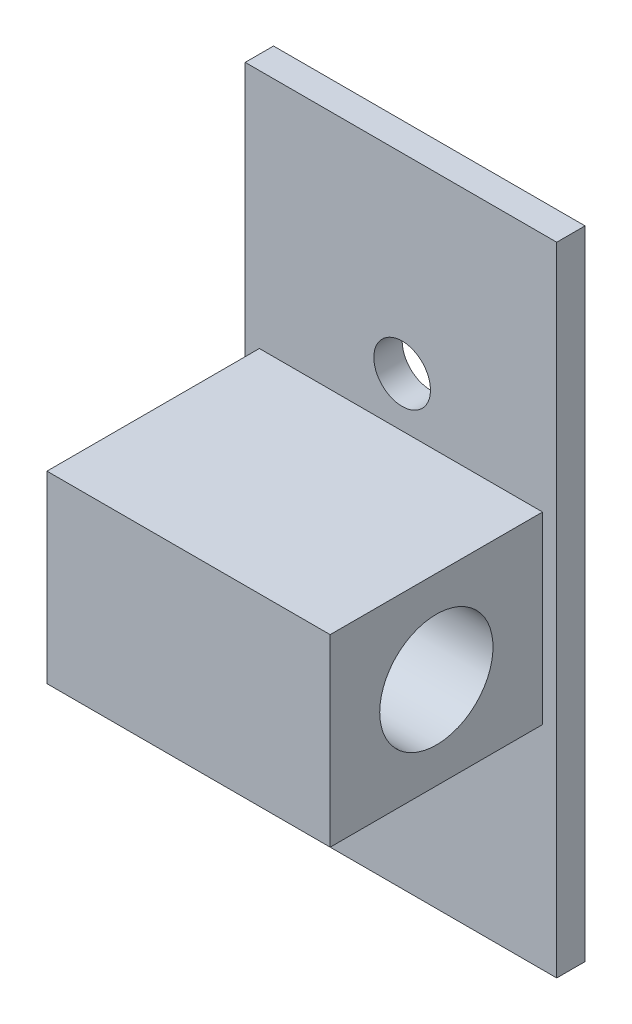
from build123d import *

# Parameters (mm, degrees)
SKETCH1_W           = 20
SKETCH1_H           = 13
BOSS_EXTRUDE1_DEPTH = 15
SKETCH2_R           = 4
CUT_EXTRUDE1_DEPTH  = 26
SKETCH3_W           = 22
SKETCH3_H           = 45
SKETCH3_R           = 2
BOSS_EXTRUDE2_DEPTH = 2


with BuildPart() as part:
    # Sketch1 → Boss-Extrude1 (new body)
    with BuildSketch(Plane.XY):
        with Locations((10, 6.5)):
            Rectangle(SKETCH1_W, SKETCH1_H)
    extrude(amount=BOSS_EXTRUDE1_DEPTH)

    # Sketch2 → Cut-Extrude1 (cut)
    with BuildSketch(Plane.ZY):
        with Locations((7.5, 6.5)):
            Circle(SKETCH2_R)
    extrude(amount=-CUT_EXTRUDE1_DEPTH, mode=Mode.SUBTRACT)

    # Sketch3 → Boss-Extrude2 (add)
    with BuildSketch(Plane(origin=(0, 0, 0), x_dir=(-1, 0, 0), z_dir=(0, 0, -1))):
        with Locations((-10, 7.5)):
            Rectangle(SKETCH3_W, SKETCH3_H)
        with Locations((-10.084414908, 16.5)):
            Circle(SKETCH3_R, mode=Mode.SUBTRACT)
        with Locations((-10.084414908, -3.5)):
            Circle(SKETCH3_R, mode=Mode.SUBTRACT)
    extrude(amount=BOSS_EXTRUDE2_DEPTH)


solid = part.part
